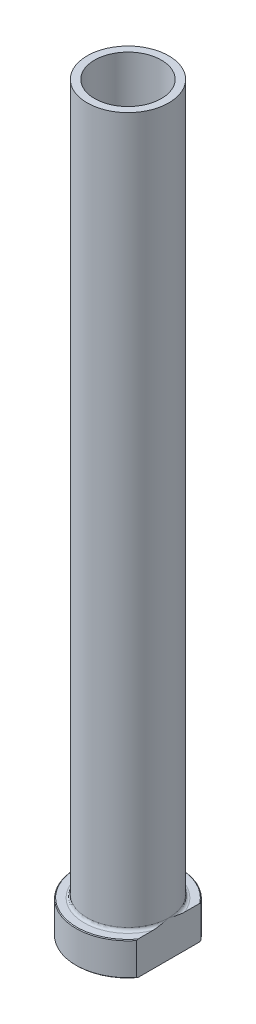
ISO-10303-21;
HEADER;
FILE_DESCRIPTION(('STEP AP214'),'2;1');
FILE_NAME('part.step','',(''),(''),'','','');
FILE_SCHEMA(('AUTOMOTIVE_DESIGN { 1 0 10303 214 1 1 1 1 }'));
ENDSEC;
DATA;
#1=APPLICATION_CONTEXT('core data for automotive mechanical design processes');
#2=APPLICATION_PROTOCOL_DEFINITION('international standard','automotive_design',2000,#1);
#3=PRODUCT_CONTEXT('',#1,'mechanical');
#4=PRODUCT('Part','Part','',(#3));
#5=PRODUCT_RELATED_PRODUCT_CATEGORY('part','',(#4));
#6=PRODUCT_DEFINITION_FORMATION('','',#4);
#7=PRODUCT_DEFINITION_CONTEXT('part definition',#1,'design');
#8=PRODUCT_DEFINITION('design','',#6,#7);
#9=PRODUCT_DEFINITION_SHAPE('','',#8);
#10=(LENGTH_UNIT() NAMED_UNIT(*) SI_UNIT(.MILLI.,.METRE.));
#11=(NAMED_UNIT(*) PLANE_ANGLE_UNIT() SI_UNIT($,.RADIAN.));
#12=(NAMED_UNIT(*) SI_UNIT($,.STERADIAN.) SOLID_ANGLE_UNIT());
#13=UNCERTAINTY_MEASURE_WITH_UNIT(LENGTH_MEASURE(1.E-05),#10,'distance_accuracy_value','');
#14=(GEOMETRIC_REPRESENTATION_CONTEXT(3) GLOBAL_UNCERTAINTY_ASSIGNED_CONTEXT((#13)) GLOBAL_UNIT_ASSIGNED_CONTEXT((#10,
#11,#12)) REPRESENTATION_CONTEXT('',''));
#15=CARTESIAN_POINT('',(0.,0.,0.));
#16=DIRECTION('',(0.,0.,1.));
#17=DIRECTION('',(1.,0.,0.));
#18=AXIS2_PLACEMENT_3D('',#15,#16,#17);
#19=CARTESIAN_POINT('',(0.,92.1876809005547,0.));
#20=DIRECTION('',(0.,1.,0.));
#21=DIRECTION('',(0.,0.,1.));
#22=AXIS2_PLACEMENT_3D('',#19,#20,#21);
#23=CYLINDRICAL_SURFACE('',#22,9.);
#24=CARTESIAN_POINT('',(0.,200.,0.));
#25=DIRECTION('',(0.,1.,0.));
#26=DIRECTION('',(0.,0.,1.));
#27=AXIS2_PLACEMENT_3D('',#24,#25,#26);
#28=CIRCLE('',#27,9.);
#29=CARTESIAN_POINT('',(0.,200.,9.));
#30=VERTEX_POINT('',#29);
#31=EDGE_CURVE('E167',#30,#30,#28,.T.);
#32=ORIENTED_EDGE('',*,*,#31,.T.);
#33=EDGE_LOOP('',(#32));
#34=FACE_BOUND('',#33,.T.);
#35=CARTESIAN_POINT('',(0.,145.,0.));
#36=DIRECTION('',(0.,1.,0.));
#37=DIRECTION('',(0.,0.,1.));
#38=AXIS2_PLACEMENT_3D('',#35,#36,#37);
#39=CIRCLE('',#38,9.);
#40=CARTESIAN_POINT('',(0.,145.,9.));
#41=VERTEX_POINT('',#40);
#42=EDGE_CURVE('E170',#41,#41,#39,.T.);
#43=ORIENTED_EDGE('',*,*,#42,.F.);
#44=EDGE_LOOP('',(#43));
#45=FACE_BOUND('',#44,.T.);
#46=ADVANCED_FACE('F32',(#34,#45),#23,.F.);
#47=CARTESIAN_POINT('',(-9.,200.,0.));
#48=DIRECTION('',(0.,1.,0.));
#49=DIRECTION('',(0.,0.,1.));
#50=AXIS2_PLACEMENT_3D('',#47,#48,#49);
#51=PLANE('',#50);
#52=CARTESIAN_POINT('',(0.,200.,0.));
#53=DIRECTION('',(0.,1.,0.));
#54=DIRECTION('',(0.,0.,1.));
#55=AXIS2_PLACEMENT_3D('',#52,#53,#54);
#56=CIRCLE('',#55,11.);
#57=CARTESIAN_POINT('',(0.,200.,11.));
#58=VERTEX_POINT('',#57);
#59=EDGE_CURVE('E174',#58,#58,#56,.T.);
#60=ORIENTED_EDGE('',*,*,#59,.T.);
#61=EDGE_LOOP('',(#60));
#62=FACE_BOUND('',#61,.T.);
#63=ORIENTED_EDGE('',*,*,#31,.F.);
#64=EDGE_LOOP('',(#63));
#65=FACE_BOUND('',#64,.T.);
#66=ADVANCED_FACE('F157',(#62,#65),#51,.T.);
#67=CARTESIAN_POINT('',(0.,92.1876809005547,0.));
#68=DIRECTION('',(0.,1.,0.));
#69=DIRECTION('',(0.,0.,1.));
#70=AXIS2_PLACEMENT_3D('',#67,#68,#69);
#71=CYLINDRICAL_SURFACE('',#70,11.);
#72=CARTESIAN_POINT('',(0.,9.8,0.));
#73=DIRECTION('',(0.,1.,0.));
#74=DIRECTION('',(0.,0.,1.));
#75=AXIS2_PLACEMENT_3D('',#72,#73,#74);
#76=CIRCLE('',#75,11.);
#77=CARTESIAN_POINT('',(11.,9.8,0.));
#78=VERTEX_POINT('',#77);
#79=EDGE_CURVE('E180',#78,#78,#76,.T.);
#80=ORIENTED_EDGE('',*,*,#79,.T.);
#81=EDGE_LOOP('',(#80));
#82=FACE_BOUND('',#81,.T.);
#83=ORIENTED_EDGE('',*,*,#59,.F.);
#84=EDGE_LOOP('',(#83));
#85=FACE_BOUND('',#84,.T.);
#86=ADVANCED_FACE('F162',(#82,#85),#71,.T.);
#87=CARTESIAN_POINT('',(-11.,9.,0.));
#88=DIRECTION('',(0.,1.,0.));
#89=DIRECTION('',(0.,0.,1.));
#90=AXIS2_PLACEMENT_3D('',#87,#88,#89);
#91=PLANE('',#90);
#92=DIRECTION('',(0.,0.,1.));
#93=VECTOR('',#92,1.);
#94=CARTESIAN_POINT('',(11.,9.,0.));
#95=LINE('',#94,#93);
#96=CARTESIAN_POINT('',(11.,9.,-8.33306666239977));
#97=VERTEX_POINT('',#96);
#98=CARTESIAN_POINT('',(11.,9.,-4.27083130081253));
#99=VERTEX_POINT('',#98);
#100=EDGE_CURVE('E54',#97,#99,#95,.T.);
#101=ORIENTED_EDGE('',*,*,#100,.F.);
#102=CARTESIAN_POINT('',(0.,9.,0.));
#103=DIRECTION('',(0.,1.,0.));
#104=DIRECTION('',(0.,0.,1.));
#105=AXIS2_PLACEMENT_3D('',#102,#103,#104);
#106=CIRCLE('',#105,13.7999999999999);
#107=CARTESIAN_POINT('',(11.,9.,8.33306666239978));
#108=VERTEX_POINT('',#107);
#109=EDGE_CURVE('E186',#97,#108,#106,.T.);
#110=ORIENTED_EDGE('',*,*,#109,.T.);
#111=CARTESIAN_POINT('',(11.,9.,4.27083130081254));
#112=VERTEX_POINT('',#111);
#113=EDGE_CURVE('E134',#112,#108,#95,.T.);
#114=ORIENTED_EDGE('',*,*,#113,.F.);
#115=CARTESIAN_POINT('',(0.,9.,0.));
#116=DIRECTION('',(0.,1.,0.));
#117=DIRECTION('',(0.,0.,1.));
#118=AXIS2_PLACEMENT_3D('',#115,#116,#117);
#119=CIRCLE('',#118,11.8);
#120=EDGE_CURVE('E183',#112,#99,#119,.F.);
#121=ORIENTED_EDGE('',*,*,#120,.T.);
#122=EDGE_LOOP('',(#101,#110,#114,#121));
#123=FACE_BOUND('',#122,.T.);
#124=ADVANCED_FACE('F197',(#123),#91,.T.);
#125=CARTESIAN_POINT('',(0.,92.1876809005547,0.));
#126=DIRECTION('',(0.,1.,0.));
#127=DIRECTION('',(0.,0.,1.));
#128=AXIS2_PLACEMENT_3D('',#125,#126,#127);
#129=CYLINDRICAL_SURFACE('',#128,14.);
#130=DIRECTION('',(0.,-1.,0.));
#131=VECTOR('',#130,1.);
#132=CARTESIAN_POINT('',(11.,200.,8.66025403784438));
#133=LINE('',#132,#131);
#134=CARTESIAN_POINT('',(11.,8.79999999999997,8.66025403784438));
#135=VERTEX_POINT('',#134);
#136=CARTESIAN_POINT('',(11.,0.200000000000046,8.66025403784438));
#137=VERTEX_POINT('',#136);
#138=EDGE_CURVE('E82',#135,#137,#133,.T.);
#139=ORIENTED_EDGE('',*,*,#138,.F.);
#140=CARTESIAN_POINT('',(0.,8.79999999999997,0.));
#141=DIRECTION('',(0.,1.,0.));
#142=DIRECTION('',(0.,0.,1.));
#143=AXIS2_PLACEMENT_3D('',#140,#141,#142);
#144=CIRCLE('',#143,14.);
#145=CARTESIAN_POINT('',(11.,8.79999999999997,-8.66025403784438));
#146=VERTEX_POINT('',#145);
#147=EDGE_CURVE('E95',#135,#146,#144,.F.);
#148=ORIENTED_EDGE('',*,*,#147,.T.);
#149=DIRECTION('',(0.,-1.,0.));
#150=VECTOR('',#149,1.);
#151=CARTESIAN_POINT('',(11.,200.,-8.66025403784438));
#152=LINE('',#151,#150);
#153=CARTESIAN_POINT('',(11.,0.200000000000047,-8.66025403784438));
#154=VERTEX_POINT('',#153);
#155=EDGE_CURVE('E192',#146,#154,#152,.T.);
#156=ORIENTED_EDGE('',*,*,#155,.T.);
#157=CARTESIAN_POINT('',(0.,0.200000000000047,0.));
#158=DIRECTION('',(0.,-1.,0.));
#159=DIRECTION('',(0.,0.,-1.));
#160=AXIS2_PLACEMENT_3D('',#157,#158,#159);
#161=CIRCLE('',#160,14.);
#162=EDGE_CURVE('E98',#154,#137,#161,.F.);
#163=ORIENTED_EDGE('',*,*,#162,.T.);
#164=EDGE_LOOP('',(#139,#148,#156,#163));
#165=FACE_BOUND('',#164,.T.);
#166=ADVANCED_FACE('F190',(#165),#129,.T.);
#167=CARTESIAN_POINT('',(-14.,0.,0.));
#168=DIRECTION('',(0.,-1.,0.));
#169=DIRECTION('',(0.,0.,-1.));
#170=AXIS2_PLACEMENT_3D('',#167,#168,#169);
#171=PLANE('',#170);
#172=CARTESIAN_POINT('',(0.,0.,0.));
#173=DIRECTION('',(0.,-1.,0.));
#174=DIRECTION('',(0.,0.,-1.));
#175=AXIS2_PLACEMENT_3D('',#172,#173,#174);
#176=CIRCLE('',#175,9.74999999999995);
#177=CARTESIAN_POINT('',(0.,0.,-9.74999999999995));
#178=VERTEX_POINT('',#177);
#179=EDGE_CURVE('E40',#178,#178,#176,.F.);
#180=ORIENTED_EDGE('',*,*,#179,.T.);
#181=EDGE_LOOP('',(#180));
#182=FACE_BOUND('',#181,.T.);
#183=DIRECTION('',(0.,0.,-1.));
#184=VECTOR('',#183,1.);
#185=CARTESIAN_POINT('',(11.,0.,8.66025403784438));
#186=LINE('',#185,#184);
#187=CARTESIAN_POINT('',(11.,0.,8.33306666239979));
#188=VERTEX_POINT('',#187);
#189=CARTESIAN_POINT('',(11.,0.,-8.33306666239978));
#190=VERTEX_POINT('',#189);
#191=EDGE_CURVE('E47',#188,#190,#186,.T.);
#192=ORIENTED_EDGE('',*,*,#191,.F.);
#193=CARTESIAN_POINT('',(0.,0.,0.));
#194=DIRECTION('',(0.,-1.,0.));
#195=DIRECTION('',(0.,0.,-1.));
#196=AXIS2_PLACEMENT_3D('',#193,#194,#195);
#197=CIRCLE('',#196,13.7999999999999);
#198=EDGE_CURVE('E92',#188,#190,#197,.T.);
#199=ORIENTED_EDGE('',*,*,#198,.T.);
#200=EDGE_LOOP('',(#192,#199));
#201=FACE_BOUND('',#200,.T.);
#202=ADVANCED_FACE('F91',(#182,#201),#171,.T.);
#203=CARTESIAN_POINT('',(0.,92.1876809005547,0.));
#204=DIRECTION('',(0.,1.,0.));
#205=DIRECTION('',(0.,0.,1.));
#206=AXIS2_PLACEMENT_3D('',#203,#204,#205);
#207=CYLINDRICAL_SURFACE('',#206,9.25);
#208=CARTESIAN_POINT('',(0.,0.499999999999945,0.));
#209=DIRECTION('',(0.,-1.,0.));
#210=DIRECTION('',(0.,0.,-1.));
#211=AXIS2_PLACEMENT_3D('',#208,#209,#210);
#212=CIRCLE('',#211,9.25);
#213=CARTESIAN_POINT('',(0.,0.499999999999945,-9.25));
#214=VERTEX_POINT('',#213);
#215=EDGE_CURVE('E11',#214,#214,#212,.T.);
#216=ORIENTED_EDGE('',*,*,#215,.T.);
#217=EDGE_LOOP('',(#216));
#218=FACE_BOUND('',#217,.T.);
#219=CARTESIAN_POINT('',(0.,133.,0.));
#220=DIRECTION('',(0.,1.,0.));
#221=DIRECTION('',(0.,0.,1.));
#222=AXIS2_PLACEMENT_3D('',#219,#220,#221);
#223=CIRCLE('',#222,9.25000000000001);
#224=CARTESIAN_POINT('',(0.,133.,9.25000000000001));
#225=VERTEX_POINT('',#224);
#226=EDGE_CURVE('E172',#225,#225,#223,.T.);
#227=ORIENTED_EDGE('',*,*,#226,.T.);
#228=EDGE_LOOP('',(#227));
#229=FACE_BOUND('',#228,.T.);
#230=ADVANCED_FACE('F215',(#218,#229),#207,.F.);
#231=CARTESIAN_POINT('',(0.,133.,0.));
#232=DIRECTION('',(0.,-1.,0.));
#233=DIRECTION('',(0.,0.,-1.));
#234=AXIS2_PLACEMENT_3D('',#231,#232,#233);
#235=CONICAL_SURFACE('',#234,9.25000000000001,0.0208303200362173);
#236=ORIENTED_EDGE('',*,*,#42,.T.);
#237=EDGE_LOOP('',(#236));
#238=FACE_BOUND('',#237,.T.);
#239=ORIENTED_EDGE('',*,*,#226,.F.);
#240=EDGE_LOOP('',(#239));
#241=FACE_BOUND('',#240,.T.);
#242=ADVANCED_FACE('F111',(#238,#241),#235,.F.);
#243=CARTESIAN_POINT('',(0.,9.8,0.));
#244=DIRECTION('',(0.,1.,0.));
#245=DIRECTION('',(0.,0.,1.));
#246=AXIS2_PLACEMENT_3D('',#243,#244,#245);
#247=TOROIDAL_SURFACE('',#246,11.8,0.8);
#248=ORIENTED_EDGE('',*,*,#120,.F.);
#249=CARTESIAN_POINT('',(11.,9.8,0.));
#250=CARTESIAN_POINT('',(11.,9.80000101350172,-1.16903105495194E-10));
#251=CARTESIAN_POINT('',(11.,9.80000202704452,3.62636611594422E-07));
#252=CARTESIAN_POINT('',(11.,9.80000392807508,1.38767038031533E-06));
#253=CARTESIAN_POINT('',(11.,9.80000479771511,2.07263771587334E-06));
#254=CARTESIAN_POINT('',(11.,9.80000659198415,3.71036672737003E-06));
#255=CARTESIAN_POINT('',(11.,9.80000749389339,4.68930209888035E-06));
#256=CARTESIAN_POINT('',(11.,9.80000912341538,6.73011572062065E-06));
#257=CARTESIAN_POINT('',(11.,9.8000098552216,7.78888147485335E-06));
#258=CARTESIAN_POINT('',(11.,9.80001253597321,1.18457654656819E-05));
#259=CARTESIAN_POINT('',(11.,9.80001433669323,1.49465068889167E-05));
#260=CARTESIAN_POINT('',(11.,9.80001733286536,2.1122675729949E-05));
#261=CARTESIAN_POINT('',(11.,9.80001856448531,2.41813359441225E-05));
#262=CARTESIAN_POINT('',(11.,9.80002366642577,3.70013752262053E-05));
#263=CARTESIAN_POINT('',(11.,9.8000274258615,4.68141710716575E-05));
#264=CARTESIAN_POINT('',(11.,9.80003302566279,6.54425668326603E-05));
#265=CARTESIAN_POINT('',(11.,9.800035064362,7.41984089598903E-05));
#266=CARTESIAN_POINT('',(11.,9.80004981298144,0.000138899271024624));
#267=CARTESIAN_POINT('',(11.,9.80006088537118,0.000195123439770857));
#268=CARTESIAN_POINT('',(11.,9.80010935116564,0.000417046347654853));
#269=CARTESIAN_POINT('',(11.,9.8001557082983,0.000580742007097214));
#270=CARTESIAN_POINT('',(11.,9.80033600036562,0.00122860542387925));
#271=CARTESIAN_POINT('',(11.,9.80046404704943,0.00171390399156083));
#272=CARTESIAN_POINT('',(11.,9.80097655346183,0.00364143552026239));
#273=CARTESIAN_POINT('',(11.,9.80136837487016,0.00508221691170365));
#274=CARTESIAN_POINT('',(11.,9.80300002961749,0.0110983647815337));
#275=CARTESIAN_POINT('',(11.,9.80423069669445,0.0156755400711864));
#276=CARTESIAN_POINT('',(10.9999999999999,9.82474721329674,0.0919599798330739));
#277=CARTESIAN_POINT('',(11.,9.84411511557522,0.163651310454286));
#278=CARTESIAN_POINT('',(11.,9.88193435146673,0.304144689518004));
#279=CARTESIAN_POINT('',(11.,9.90039088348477,0.372945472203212));
#280=CARTESIAN_POINT('',(11.,9.93953155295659,0.519420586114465));
#281=CARTESIAN_POINT('',(11.,9.96019740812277,0.597099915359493));
#282=CARTESIAN_POINT('',(11.,10.0014716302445,0.753402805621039));
#283=CARTESIAN_POINT('',(11.,10.0220767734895,0.832027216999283));
#284=CARTESIAN_POINT('',(11.,10.056901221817,0.966276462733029));
#285=CARTESIAN_POINT('',(11.,10.0712190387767,1.02187571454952));
#286=CARTESIAN_POINT('',(11.,10.0995828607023,1.13298938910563));
#287=CARTESIAN_POINT('',(11.,10.1136294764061,1.18850365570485));
#288=CARTESIAN_POINT('',(11.,10.1546367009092,1.35225812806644));
#289=CARTESIAN_POINT('',(11.,10.1812165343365,1.46059357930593));
#290=CARTESIAN_POINT('',(11.,10.2669117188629,1.81933910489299));
#291=CARTESIAN_POINT('',(11.,10.3231642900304,2.0704465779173));
#292=CARTESIAN_POINT('',(11.,10.425012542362,2.5777982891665));
#293=CARTESIAN_POINT('',(11.,10.4704839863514,2.83406864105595));
#294=CARTESIAN_POINT('',(11.,10.5272211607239,3.23096220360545));
#295=CARTESIAN_POINT('',(11.,10.5446090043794,3.37070252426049));
#296=CARTESIAN_POINT('',(11.,10.5730475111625,3.65081430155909));
#297=CARTESIAN_POINT('',(11.,10.5840998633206,3.79118557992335));
#298=CARTESIAN_POINT('',(11.,10.5982304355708,4.07161741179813));
#299=CARTESIAN_POINT('',(11.,10.6013499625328,4.21167576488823));
#300=CARTESIAN_POINT('',(11.,10.5975625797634,4.49161919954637));
#301=CARTESIAN_POINT('',(11.,10.5906655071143,4.63150431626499));
#302=CARTESIAN_POINT('',(11.,10.5704363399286,4.83931097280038));
#303=CARTESIAN_POINT('',(11.,10.562146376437,4.90772588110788));
#304=CARTESIAN_POINT('',(11.,10.5417448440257,5.04405523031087));
#305=CARTESIAN_POINT('',(11.,10.5296301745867,5.11196921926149));
#306=CARTESIAN_POINT('',(11.,10.5009997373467,5.24610291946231));
#307=CARTESIAN_POINT('',(11.,10.4845340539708,5.31233305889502));
#308=CARTESIAN_POINT('',(11.,10.4461783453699,5.44314716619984));
#309=CARTESIAN_POINT('',(11.,10.4242944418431,5.50773290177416));
#310=CARTESIAN_POINT('',(11.,10.373421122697,5.63494480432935));
#311=CARTESIAN_POINT('',(11.,10.3443615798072,5.69754429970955));
#312=CARTESIAN_POINT('',(11.,10.2940125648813,5.7875857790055));
#313=CARTESIAN_POINT('',(11.,10.2761248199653,5.8169284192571));
#314=CARTESIAN_POINT('',(11.,10.2377448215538,5.87384301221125));
#315=CARTESIAN_POINT('',(11.,10.2172553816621,5.9014168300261));
#316=CARTESIAN_POINT('',(11.,10.1754926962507,5.95144540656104));
#317=CARTESIAN_POINT('',(11.,10.1545053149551,5.9741361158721));
#318=CARTESIAN_POINT('',(11.,10.1098178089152,6.01675330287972));
#319=CARTESIAN_POINT('',(11.,10.0861159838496,6.03667803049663));
#320=CARTESIAN_POINT('',(11.,10.0355211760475,6.07288913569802));
#321=CARTESIAN_POINT('',(11.,10.0085887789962,6.08912169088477));
#322=CARTESIAN_POINT('',(11.,9.95208821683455,6.11604527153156));
#323=CARTESIAN_POINT('',(11.,9.92252876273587,6.12675386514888));
#324=CARTESIAN_POINT('',(11.,9.87044933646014,6.13915978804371));
#325=CARTESIAN_POINT('',(11.,9.84833164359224,6.14255775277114));
#326=CARTESIAN_POINT('',(11.,9.80383923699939,6.1455308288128));
#327=CARTESIAN_POINT('',(11.,9.78146463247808,6.14510750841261));
#328=CARTESIAN_POINT('',(11.,9.73715415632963,6.14047859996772));
#329=CARTESIAN_POINT('',(11.,9.71521765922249,6.13627886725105));
#330=CARTESIAN_POINT('',(11.,9.67228934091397,6.12446633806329));
#331=CARTESIAN_POINT('',(11.,9.65129820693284,6.11685110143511));
#332=CARTESIAN_POINT('',(11.,9.60293880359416,6.09531376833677));
#333=CARTESIAN_POINT('',(11.,9.57614979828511,6.08009633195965));
#334=CARTESIAN_POINT('',(11.,9.52533680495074,6.04559207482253));
#335=CARTESIAN_POINT('',(11.,9.50131971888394,6.02629542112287));
#336=CARTESIAN_POINT('',(11.,9.44252607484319,5.97248581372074));
#337=CARTESIAN_POINT('',(11.,9.40981527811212,5.93573547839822));
#338=CARTESIAN_POINT('',(11.,9.35019076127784,5.85789950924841));
#339=CARTESIAN_POINT('',(11.,9.3232859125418,5.81680738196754));
#340=CARTESIAN_POINT('',(11.,9.2753124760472,5.73382009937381));
#341=CARTESIAN_POINT('',(11.,9.25403723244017,5.69204233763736));
#342=CARTESIAN_POINT('',(11.,9.21507165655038,5.60682590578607));
#343=CARTESIAN_POINT('',(11.,9.19738479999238,5.56338567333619));
#344=CARTESIAN_POINT('',(11.,9.16492416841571,5.47505507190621));
#345=CARTESIAN_POINT('',(11.,9.1501744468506,5.43015597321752));
#346=CARTESIAN_POINT('',(11.,9.12332484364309,5.33960740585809));
#347=CARTESIAN_POINT('',(11.,9.11122363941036,5.29395832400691));
#348=CARTESIAN_POINT('',(11.,9.08512909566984,5.18461425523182));
#349=CARTESIAN_POINT('',(11.,9.07217244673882,5.1206724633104));
#350=CARTESIAN_POINT('',(11.,9.04991113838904,4.99214785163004));
#351=CARTESIAN_POINT('',(11.,9.04060805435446,4.92756476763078));
#352=CARTESIAN_POINT('',(11.,9.0173183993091,4.73294213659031));
#353=CARTESIAN_POINT('',(11.,9.00801869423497,4.60233754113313));
#354=CARTESIAN_POINT('',(11.,8.99902947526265,4.34550193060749));
#355=CARTESIAN_POINT('',(11.,8.99901276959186,4.21927902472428));
#356=CARTESIAN_POINT('',(11.,9.0059592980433,3.96771196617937));
#357=CARTESIAN_POINT('',(11.,9.01288556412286,3.84236670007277));
#358=CARTESIAN_POINT('',(11.,9.03307410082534,3.58284783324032));
#359=CARTESIAN_POINT('',(11.,9.0467683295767,3.44870920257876));
#360=CARTESIAN_POINT('',(11.,9.07939011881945,3.18114709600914));
#361=CARTESIAN_POINT('',(11.,9.09831526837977,3.04772331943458));
#362=CARTESIAN_POINT('',(11.,9.14092023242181,2.77842123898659));
#363=CARTESIAN_POINT('',(11.,9.16470161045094,2.64255921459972));
#364=CARTESIAN_POINT('',(11.,9.21593088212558,2.37116504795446));
#365=CARTESIAN_POINT('',(11.,9.24338827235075,2.23563471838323));
#366=CARTESIAN_POINT('',(11.,9.31183649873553,1.91532204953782));
#367=CARTESIAN_POINT('',(11.,9.35408384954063,1.73080986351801));
#368=CARTESIAN_POINT('',(11.,9.44184141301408,1.36477440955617));
#369=CARTESIAN_POINT('',(11.,9.48730948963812,1.18324089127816));
#370=CARTESIAN_POINT('',(11.,9.55452451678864,0.921934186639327));
#371=CARTESIAN_POINT('',(11.,9.5753457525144,0.841920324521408));
#372=CARTESIAN_POINT('',(11.,9.61742284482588,0.681633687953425));
#373=CARTESIAN_POINT('',(11.,9.63868020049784,0.601361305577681));
#374=CARTESIAN_POINT('',(11.,9.68246779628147,0.436916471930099));
#375=CARTESIAN_POINT('',(11.,9.70500908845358,0.352747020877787));
#376=CARTESIAN_POINT('',(11.,9.74991333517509,0.185809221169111));
#377=CARTESIAN_POINT('',(11.0000000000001,9.77227331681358,0.103040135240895));
#378=CARTESIAN_POINT('',(11.,9.79577053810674,0.0156708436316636));
#379=CARTESIAN_POINT('',(11.,9.79700248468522,0.0110889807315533));
#380=CARTESIAN_POINT('',(11.,9.79863444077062,0.00507176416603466));
#381=CARTESIAN_POINT('',(11.,9.79902527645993,0.00363459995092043));
#382=CARTESIAN_POINT('',(11.,9.79953658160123,0.00171158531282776));
#383=CARTESIAN_POINT('',(11.,9.79966439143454,0.00122718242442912));
#384=CARTESIAN_POINT('',(11.,9.79984439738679,0.000580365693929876));
#385=CARTESIAN_POINT('',(11.,9.79989071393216,0.000416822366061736));
#386=CARTESIAN_POINT('',(11.,9.79993914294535,0.000195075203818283));
#387=CARTESIAN_POINT('',(11.,9.79995021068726,0.000138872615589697));
#388=CARTESIAN_POINT('',(11.,9.79996494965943,7.41937214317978E-05));
#389=CARTESIAN_POINT('',(11.,9.7999669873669,6.54390977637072E-05));
#390=CARTESIAN_POINT('',(11.,9.79997258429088,4.68131828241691E-05));
#391=CARTESIAN_POINT('',(11.,9.7999763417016,3.70015847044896E-05));
#392=CARTESIAN_POINT('',(11.,9.7999814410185,2.41827815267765E-05));
#393=CARTESIAN_POINT('',(11.,9.7999826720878,2.11242125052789E-05));
#394=CARTESIAN_POINT('',(11.,9.79998566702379,1.49481337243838E-05));
#395=CARTESIAN_POINT('',(11.,9.799987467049,1.18473801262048E-05));
#396=CARTESIAN_POINT('',(11.,9.79999014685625,7.79037186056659E-06));
#397=CARTESIAN_POINT('',(11.,9.79999087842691,6.73154396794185E-06));
#398=CARTESIAN_POINT('',(11.,9.79999250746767,4.69056355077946E-06));
#399=CARTESIAN_POINT('',(11.,9.79999340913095,3.71152211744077E-06));
#400=CARTESIAN_POINT('',(11.,9.79999520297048,2.07354302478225E-06));
#401=CARTESIAN_POINT('',(11.,9.79999607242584,1.38844074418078E-06));
#402=CARTESIAN_POINT('',(11.,9.79999797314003,3.63067575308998E-07));
#403=CARTESIAN_POINT('',(11.,9.79999898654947,1.16901609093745E-10));
#404=CARTESIAN_POINT('',(11.,9.8,0.));
#405=B_SPLINE_CURVE_WITH_KNOTS('',3,(#249,#250,#251,#252,#253,#254,#255,#256,#257,#258,#259,
#260,#261,#262,#263,#264,#265,#266,#267,#268,#269,#270,#271,#272,#273,#274,#275,#276,#277,#278,
#279,#280,#281,#282,#283,#284,#285,#286,#287,#288,#289,#290,#291,#292,#293,#294,#295,#296,#297,
#298,#299,#300,#301,#302,#303,#304,#305,#306,#307,#308,#309,#310,#311,#312,#313,#314,#315,#316,
#317,#318,#319,#320,#321,#322,#323,#324,#325,#326,#327,#328,#329,#330,#331,#332,#333,#334,#335,
#336,#337,#338,#339,#340,#341,#342,#343,#344,#345,#346,#347,#348,#349,#350,#351,#352,#353,#354,
#355,#356,#357,#358,#359,#360,#361,#362,#363,#364,#365,#366,#367,#368,#369,#370,#371,#372,#373,
#374,#375,#376,#377,#378,#379,#380,#381,#382,#383,#384,#385,#386,#387,#388,#389,#390,#391,#392,
#393,#394,#395,#396,#397,#398,#399,#400,#401,#402,#403,#404),.UNSPECIFIED.,.T.,.F.,(4,2,2,2,2,2,
2,2,2,2,2,2,2,2,2,2,2,2,2,2,2,2,2,2,2,2,2,2,2,2,2,2,2,2,2,2,2,2,2,2,2,2,2,2,2,2,2,2,2,2,2,2,2,2,
2,2,2,2,2,2,2,2,2,2,2,2,2,2,2,2,2,2,2,2,2,2,2,4),(0.,3.06076108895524E-06,6.37973544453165E-06,
1.03502668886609E-05,1.42089725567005E-05,2.49252559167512E-05,3.48085548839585E-05,
6.62739386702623E-05,9.32104436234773E-05,0.000265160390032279,0.000775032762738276,
0.0022812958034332,0.00675996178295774,0.0209798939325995,0.24375656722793,0.457458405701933,
0.698601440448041,0.942439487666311,1.11467870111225,1.28646938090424,1.62111125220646,
2.39296447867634,3.17332138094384,3.59566656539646,4.01789910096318,4.43792849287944,
4.85754566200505,5.06420795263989,5.27103820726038,5.47558418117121,5.67990009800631,
5.88629782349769,5.9892848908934,6.09216151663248,6.18469603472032,6.27728883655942,
6.3711554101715,6.46472158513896,6.53154940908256,6.59834980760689,6.66504681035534,
6.73179153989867,6.82369899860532,6.91583057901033,7.06259901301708,7.20959014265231,
7.35003074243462,7.49060673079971,7.63229046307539,7.77390328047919,7.96948934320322,
8.1651596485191,8.55744262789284,8.93589815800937,9.31234923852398,9.71673016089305,
10.120925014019,10.5346477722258,10.9494607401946,11.5172595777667,12.0786596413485,
12.3266950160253,12.575811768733,12.8372206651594,13.0944202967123,13.1086548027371,
13.1131222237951,13.1146257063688,13.1151351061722,13.1153069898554,13.1153339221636,
13.1153653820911,13.115375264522,13.1153859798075,13.1153898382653,13.1153938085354,
13.115397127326,13.1154001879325),.UNSPECIFIED.);
#406=EDGE_CURVE('E126',#112,#78,#405,.T.);
#407=ORIENTED_EDGE('',*,*,#406,.T.);
#408=ORIENTED_EDGE('',*,*,#79,.F.);
#409=CARTESIAN_POINT('',(11.,9.8,0.));
#410=CARTESIAN_POINT('',(11.,9.79999898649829,1.1690706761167E-10));
#411=CARTESIAN_POINT('',(11.,9.79999797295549,-3.6263660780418E-07));
#412=CARTESIAN_POINT('',(11.,9.79999607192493,-1.38767037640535E-06));
#413=CARTESIAN_POINT('',(11.,9.79999520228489,-2.07263771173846E-06));
#414=CARTESIAN_POINT('',(11.,9.79999340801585,-3.71036672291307E-06));
#415=CARTESIAN_POINT('',(11.,9.79999250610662,-4.68930209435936E-06));
#416=CARTESIAN_POINT('',(11.,9.79999087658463,-6.73011571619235E-06));
#417=CARTESIAN_POINT('',(11.,9.7999901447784,-7.78888147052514E-06));
#418=CARTESIAN_POINT('',(11.,9.7999874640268,-1.18457654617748E-05));
#419=CARTESIAN_POINT('',(11.,9.79998566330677,-1.49465068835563E-05));
#420=CARTESIAN_POINT('',(11.,9.79998266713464,-2.11226757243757E-05));
#421=CARTESIAN_POINT('',(11.,9.79998143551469,-2.41813359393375E-05));
#422=CARTESIAN_POINT('',(11.,9.79997633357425,-3.7001375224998E-05));
#423=CARTESIAN_POINT('',(11.,9.79997257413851,-4.68141710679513E-05));
#424=CARTESIAN_POINT('',(11.,9.79996697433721,-6.54425668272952E-05));
#425=CARTESIAN_POINT('',(11.,9.79996493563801,-7.4198408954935E-05));
#426=CARTESIAN_POINT('',(11.,9.79995018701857,-0.00013889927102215));
#427=CARTESIAN_POINT('',(11.,9.79993911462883,-0.000195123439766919));
#428=CARTESIAN_POINT('',(11.,9.79989064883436,-0.000417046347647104));
#429=CARTESIAN_POINT('',(11.,9.7998442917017,-0.000580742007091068));
#430=CARTESIAN_POINT('',(11.,9.79966399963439,-0.00122860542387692));
#431=CARTESIAN_POINT('',(11.,9.79953595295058,-0.00171390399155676));
#432=CARTESIAN_POINT('',(11.,9.79902344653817,-0.00364143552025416));
#433=CARTESIAN_POINT('',(11.,9.79863162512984,-0.00508221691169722));
#434=CARTESIAN_POINT('',(11.,9.79699997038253,-0.0110983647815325));
#435=CARTESIAN_POINT('',(11.,9.79576930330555,-0.0156755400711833));
#436=CARTESIAN_POINT('',(10.9999999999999,9.7752527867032,-0.0919599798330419));
#437=CARTESIAN_POINT('',(11.,9.75588488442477,-0.163651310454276));
#438=CARTESIAN_POINT('',(11.,9.71806564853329,-0.30414468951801));
#439=CARTESIAN_POINT('',(11.,9.69960911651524,-0.372945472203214));
#440=CARTESIAN_POINT('',(11.,9.66046844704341,-0.519420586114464));
#441=CARTESIAN_POINT('',(11.,9.63980259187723,-0.597099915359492));
#442=CARTESIAN_POINT('',(11.,9.59852836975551,-0.753402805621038));
#443=CARTESIAN_POINT('',(11.,9.57792322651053,-0.832027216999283));
#444=CARTESIAN_POINT('',(11.,9.54309877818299,-0.966276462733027));
#445=CARTESIAN_POINT('',(11.,9.52878096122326,-1.02187571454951));
#446=CARTESIAN_POINT('',(11.,9.50041713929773,-1.13298938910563));
#447=CARTESIAN_POINT('',(11.,9.48637052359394,-1.18850365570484));
#448=CARTESIAN_POINT('',(11.,9.44536329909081,-1.35225812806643));
#449=CARTESIAN_POINT('',(11.,9.41878346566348,-1.46059357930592));
#450=CARTESIAN_POINT('',(11.,9.33308828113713,-1.81933910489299));
#451=CARTESIAN_POINT('',(11.,9.27683570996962,-2.0704465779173));
#452=CARTESIAN_POINT('',(11.,9.17498745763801,-2.5777982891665));
#453=CARTESIAN_POINT('',(11.,9.1295160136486,-2.83406864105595));
#454=CARTESIAN_POINT('',(11.,9.07277883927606,-3.23096220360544));
#455=CARTESIAN_POINT('',(11.,9.05539099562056,-3.37070252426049));
#456=CARTESIAN_POINT('',(11.,9.02695248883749,-3.65081430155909));
#457=CARTESIAN_POINT('',(11.,9.01590013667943,-3.79118557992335));
#458=CARTESIAN_POINT('',(11.,9.00176956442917,-4.07161741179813));
#459=CARTESIAN_POINT('',(11.,8.99865003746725,-4.21167576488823));
#460=CARTESIAN_POINT('',(11.,9.00243742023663,-4.49161919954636));
#461=CARTESIAN_POINT('',(11.,9.00933449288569,-4.63150431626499));
#462=CARTESIAN_POINT('',(11.,9.02956366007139,-4.83931097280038));
#463=CARTESIAN_POINT('',(11.,9.037853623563,-4.90772588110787));
#464=CARTESIAN_POINT('',(11.,9.05825515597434,-5.04405523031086));
#465=CARTESIAN_POINT('',(11.,9.07036982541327,-5.11196921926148));
#466=CARTESIAN_POINT('',(11.,9.09900026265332,-5.2461029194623));
#467=CARTESIAN_POINT('',(11.,9.11546594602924,-5.31233305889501));
#468=CARTESIAN_POINT('',(11.,9.15382165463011,-5.44314716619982));
#469=CARTESIAN_POINT('',(11.,9.17570555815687,-5.50773290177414));
#470=CARTESIAN_POINT('',(11.,9.22657887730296,-5.63494480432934));
#471=CARTESIAN_POINT('',(11.,9.25563842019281,-5.69754429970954));
#472=CARTESIAN_POINT('',(11.,9.30598743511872,-5.78758577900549));
#473=CARTESIAN_POINT('',(11.,9.32387518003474,-5.81692841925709));
#474=CARTESIAN_POINT('',(11.,9.36225517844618,-5.87384301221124));
#475=CARTESIAN_POINT('',(11.,9.38274461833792,-5.90141683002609));
#476=CARTESIAN_POINT('',(11.,9.42450730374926,-5.95144540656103));
#477=CARTESIAN_POINT('',(11.,9.44549468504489,-5.97413611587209));
#478=CARTESIAN_POINT('',(11.,9.49018219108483,-6.01675330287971));
#479=CARTESIAN_POINT('',(11.,9.51388401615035,-6.03667803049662));
#480=CARTESIAN_POINT('',(11.,9.56447882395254,-6.072889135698));
#481=CARTESIAN_POINT('',(11.,9.59141122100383,-6.08912169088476));
#482=CARTESIAN_POINT('',(11.,9.64791178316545,-6.11604527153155));
#483=CARTESIAN_POINT('',(11.,9.67747123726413,-6.12675386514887));
#484=CARTESIAN_POINT('',(11.,9.72955066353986,-6.1391597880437));
#485=CARTESIAN_POINT('',(11.,9.75166835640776,-6.14255775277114));
#486=CARTESIAN_POINT('',(11.,9.79616076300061,-6.14553082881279));
#487=CARTESIAN_POINT('',(11.,9.81853536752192,-6.1451075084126));
#488=CARTESIAN_POINT('',(11.,9.86284584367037,-6.14047859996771));
#489=CARTESIAN_POINT('',(11.,9.88478234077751,-6.13627886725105));
#490=CARTESIAN_POINT('',(11.,9.92771065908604,-6.12446633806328));
#491=CARTESIAN_POINT('',(11.,9.94870179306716,-6.1168511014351));
#492=CARTESIAN_POINT('',(11.,9.99706119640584,-6.09531376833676));
#493=CARTESIAN_POINT('',(11.,10.0238502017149,-6.08009633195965));
#494=CARTESIAN_POINT('',(11.,10.0746631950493,-6.04559207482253));
#495=CARTESIAN_POINT('',(11.,10.0986802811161,-6.02629542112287));
#496=CARTESIAN_POINT('',(11.,10.1574739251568,-5.97248581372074));
#497=CARTESIAN_POINT('',(11.,10.1901847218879,-5.93573547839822));
#498=CARTESIAN_POINT('',(11.,10.2498092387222,-5.85789950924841));
#499=CARTESIAN_POINT('',(11.,10.2767140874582,-5.81680738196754));
#500=CARTESIAN_POINT('',(11.,10.3246875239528,-5.73382009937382));
#501=CARTESIAN_POINT('',(11.,10.3459627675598,-5.69204233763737));
#502=CARTESIAN_POINT('',(11.,10.3849283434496,-5.60682590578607));
#503=CARTESIAN_POINT('',(11.,10.4026152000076,-5.5633856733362));
#504=CARTESIAN_POINT('',(11.,10.4350758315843,-5.47505507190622));
#505=CARTESIAN_POINT('',(11.,10.4498255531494,-5.43015597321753));
#506=CARTESIAN_POINT('',(11.,10.4766751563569,-5.3396074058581));
#507=CARTESIAN_POINT('',(11.,10.4887763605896,-5.29395832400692));
#508=CARTESIAN_POINT('',(11.,10.5148709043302,-5.18461425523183));
#509=CARTESIAN_POINT('',(11.,10.5278275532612,-5.12067246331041));
#510=CARTESIAN_POINT('',(11.,10.550088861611,-4.99214785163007));
#511=CARTESIAN_POINT('',(11.,10.5593919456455,-4.9275647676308));
#512=CARTESIAN_POINT('',(11.,10.5826816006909,-4.73294213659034));
#513=CARTESIAN_POINT('',(11.,10.591981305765,-4.60233754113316));
#514=CARTESIAN_POINT('',(11.,10.6009705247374,-4.34550193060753));
#515=CARTESIAN_POINT('',(11.,10.6009872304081,-4.21927902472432));
#516=CARTESIAN_POINT('',(11.,10.5940407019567,-3.96771196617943));
#517=CARTESIAN_POINT('',(11.,10.5871144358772,-3.84236670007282));
#518=CARTESIAN_POINT('',(11.,10.5669258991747,-3.58284783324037));
#519=CARTESIAN_POINT('',(11.,10.5532316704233,-3.44870920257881));
#520=CARTESIAN_POINT('',(11.,10.5206098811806,-3.18114709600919));
#521=CARTESIAN_POINT('',(11.,10.5016847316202,-3.04772331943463));
#522=CARTESIAN_POINT('',(11.,10.4590797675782,-2.77842123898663));
#523=CARTESIAN_POINT('',(11.,10.4352983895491,-2.64255921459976));
#524=CARTESIAN_POINT('',(11.,10.3840691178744,-2.3711650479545));
#525=CARTESIAN_POINT('',(11.,10.3566117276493,-2.23563471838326));
#526=CARTESIAN_POINT('',(11.,10.2881635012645,-1.91532204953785));
#527=CARTESIAN_POINT('',(11.,10.2459161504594,-1.73080986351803));
#528=CARTESIAN_POINT('',(11.,10.1581585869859,-1.36477440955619));
#529=CARTESIAN_POINT('',(11.,10.1126905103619,-1.18324089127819));
#530=CARTESIAN_POINT('',(11.,10.0454754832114,-0.921934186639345));
#531=CARTESIAN_POINT('',(11.,10.0246542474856,-0.841920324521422));
#532=CARTESIAN_POINT('',(11.,9.98257715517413,-0.681633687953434));
#533=CARTESIAN_POINT('',(11.,9.96131979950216,-0.60136130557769));
#534=CARTESIAN_POINT('',(11.,9.91753220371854,-0.436916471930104));
#535=CARTESIAN_POINT('',(11.,9.89499091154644,-0.352747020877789));
#536=CARTESIAN_POINT('',(11.,9.85008666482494,-0.185809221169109));
#537=CARTESIAN_POINT('',(10.9999999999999,9.82772668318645,-0.103040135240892));
#538=CARTESIAN_POINT('',(11.,9.80422946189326,-0.0156708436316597));
#539=CARTESIAN_POINT('',(11.,9.80299751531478,-0.0110889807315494));
#540=CARTESIAN_POINT('',(11.,9.80136555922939,-0.00507176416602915));
#541=CARTESIAN_POINT('',(11.,9.80097472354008,-0.00363459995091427));
#542=CARTESIAN_POINT('',(11.,9.80046341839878,-0.00171158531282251));
#543=CARTESIAN_POINT('',(11.,9.80033560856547,-0.00122718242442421));
#544=CARTESIAN_POINT('',(11.,9.80015560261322,-0.000580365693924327));
#545=CARTESIAN_POINT('',(11.,9.80010928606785,-0.000416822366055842));
#546=CARTESIAN_POINT('',(11.,9.80006085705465,-0.00019507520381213));
#547=CARTESIAN_POINT('',(11.,9.80004978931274,-0.000138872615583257));
#548=CARTESIAN_POINT('',(11.,9.80003505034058,-7.41937214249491E-05));
#549=CARTESIAN_POINT('',(11.,9.80003301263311,-6.5439097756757E-05));
#550=CARTESIAN_POINT('',(11.,9.80002741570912,-4.68131828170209E-05));
#551=CARTESIAN_POINT('',(11.,9.80002365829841,-3.7001584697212E-05));
#552=CARTESIAN_POINT('',(11.,9.80001855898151,-2.41827815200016E-05));
#553=CARTESIAN_POINT('',(11.,9.80001732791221,-2.11242124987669E-05));
#554=CARTESIAN_POINT('',(11.,9.80001433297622,-1.49481337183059E-05));
#555=CARTESIAN_POINT('',(11.,9.80001253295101,-1.18473801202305E-05));
#556=CARTESIAN_POINT('',(11.,9.80000985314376,-7.79037185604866E-06));
#557=CARTESIAN_POINT('',(11.,9.8000091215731,-6.73154396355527E-06));
#558=CARTESIAN_POINT('',(11.,9.80000749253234,-4.69056354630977E-06));
#559=CARTESIAN_POINT('',(11.,9.80000659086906,-3.71152211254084E-06));
#560=CARTESIAN_POINT('',(11.,9.80000479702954,-2.07354301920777E-06));
#561=CARTESIAN_POINT('',(11.,9.80000392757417,-1.38844073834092E-06));
#562=CARTESIAN_POINT('',(11.,9.80000202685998,-3.63067570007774E-07));
#563=CARTESIAN_POINT('',(11.,9.80000101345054,-1.16896757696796E-10));
#564=CARTESIAN_POINT('',(11.,9.8,0.));
#565=B_SPLINE_CURVE_WITH_KNOTS('',3,(#409,#410,#411,#412,#413,#414,#415,#416,#417,#418,#419,
#420,#421,#422,#423,#424,#425,#426,#427,#428,#429,#430,#431,#432,#433,#434,#435,#436,#437,#438,
#439,#440,#441,#442,#443,#444,#445,#446,#447,#448,#449,#450,#451,#452,#453,#454,#455,#456,#457,
#458,#459,#460,#461,#462,#463,#464,#465,#466,#467,#468,#469,#470,#471,#472,#473,#474,#475,#476,
#477,#478,#479,#480,#481,#482,#483,#484,#485,#486,#487,#488,#489,#490,#491,#492,#493,#494,#495,
#496,#497,#498,#499,#500,#501,#502,#503,#504,#505,#506,#507,#508,#509,#510,#511,#512,#513,#514,
#515,#516,#517,#518,#519,#520,#521,#522,#523,#524,#525,#526,#527,#528,#529,#530,#531,#532,#533,
#534,#535,#536,#537,#538,#539,#540,#541,#542,#543,#544,#545,#546,#547,#548,#549,#550,#551,#552,
#553,#554,#555,#556,#557,#558,#559,#560,#561,#562,#563,#564),.UNSPECIFIED.,.T.,.F.,(4,2,2,2,2,2,
2,2,2,2,2,2,2,2,2,2,2,2,2,2,2,2,2,2,2,2,2,2,2,2,2,2,2,2,2,2,2,2,2,2,2,2,2,2,2,2,2,2,2,2,2,2,2,2,
2,2,2,2,2,2,2,2,2,2,2,2,2,2,2,2,2,2,2,2,2,2,2,4),(0.,3.06076108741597E-06,6.37973544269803E-06,
1.03502668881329E-05,1.42089725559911E-05,2.49252559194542E-05,3.48085548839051E-05,
6.6273938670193E-05,9.32104436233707E-05,0.000265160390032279,0.000775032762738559,
0.0022812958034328,0.00675996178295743,0.0209798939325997,0.243756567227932,0.457458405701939,
0.698601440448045,0.942439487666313,1.11467870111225,1.28646938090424,1.62111125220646,
2.39296447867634,3.17332138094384,3.59566656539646,4.01789910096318,4.43792849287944,
4.85754566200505,5.06420795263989,5.27103820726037,5.4755841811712,5.6799000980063,
5.88629782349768,5.98928489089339,6.09216151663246,6.18469603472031,6.27728883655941,
6.37115541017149,6.46472158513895,6.53154940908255,6.59834980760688,6.66504681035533,
6.73179153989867,6.82369899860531,6.91583057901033,7.06259901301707,7.2095901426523,
7.35003074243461,7.49060673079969,7.63229046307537,7.77390328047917,7.9694893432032,
8.16515964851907,8.5574426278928,8.93589815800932,9.31234923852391,9.716730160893,
10.1209250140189,10.5346477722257,10.9494607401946,11.5172595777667,12.0786596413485,
12.3266950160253,12.575811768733,12.8372206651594,13.0944202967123,13.1086548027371,
13.1131222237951,13.1146257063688,13.1151351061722,13.1153069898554,13.1153339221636,
13.1153653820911,13.115375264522,13.1153859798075,13.1153898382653,13.1153938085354,
13.115397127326,13.1154001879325),.UNSPECIFIED.);
#566=EDGE_CURVE('E135',#78,#99,#565,.T.);
#567=ORIENTED_EDGE('',*,*,#566,.T.);
#568=EDGE_LOOP('',(#248,#407,#408,#567));
#569=FACE_BOUND('',#568,.T.);
#570=ADVANCED_FACE('F141',(#569),#247,.F.);
#571=CARTESIAN_POINT('',(0.,8.99999999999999,0.));
#572=DIRECTION('',(0.,-1.,0.));
#573=DIRECTION('',(0.,0.,-1.));
#574=AXIS2_PLACEMENT_3D('',#571,#572,#573);
#575=CONICAL_SURFACE('',#574,13.7999999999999,0.785398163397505);
#576=CARTESIAN_POINT('',(11.,0.799226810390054,-19.0534516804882));
#577=CARTESIAN_POINT('',(11.,1.04353773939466,-18.7713380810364));
#578=CARTESIAN_POINT('',(11.,1.287085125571,-18.4885613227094));
#579=CARTESIAN_POINT('',(11.,1.77243087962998,-17.9215029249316));
#580=CARTESIAN_POINT('',(11.,2.01422921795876,-17.6372212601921));
#581=CARTESIAN_POINT('',(11.,2.49596158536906,-17.0668479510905));
#582=CARTESIAN_POINT('',(11.,2.73589466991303,-16.7807555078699));
#583=CARTESIAN_POINT('',(11.,3.21348992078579,-16.206686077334));
#584=CARTESIAN_POINT('',(11.,3.45115209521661,-15.9187090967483));
#585=CARTESIAN_POINT('',(11.,4.1713625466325,-15.0380400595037));
#586=CARTESIAN_POINT('',(11.,4.64980550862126,-14.4419631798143));
#587=CARTESIAN_POINT('',(11.,5.35642548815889,-13.5393158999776));
#588=CARTESIAN_POINT('',(11.,5.59010018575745,-13.237044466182));
#589=CARTESIAN_POINT('',(11.,6.05311937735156,-12.6292064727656));
#590=CARTESIAN_POINT('',(11.,6.28246396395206,-12.3236399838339));
#591=CARTESIAN_POINT('',(11.,6.73635357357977,-11.7082856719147));
#592=CARTESIAN_POINT('',(11.,6.96089131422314,-11.3984924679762));
#593=CARTESIAN_POINT('',(11.,7.40382501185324,-10.7745304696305));
#594=CARTESIAN_POINT('',(11.,7.62222089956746,-10.4603616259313));
#595=CARTESIAN_POINT('',(11.,8.05178447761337,-9.82670701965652));
#596=CARTESIAN_POINT('',(11.,8.26294571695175,-9.50721687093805));
#597=CARTESIAN_POINT('',(11.,8.67621603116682,-8.8624224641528));
#598=CARTESIAN_POINT('',(11.,8.87832530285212,-8.53711833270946));
#599=CARTESIAN_POINT('',(11.,9.26987187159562,-7.88242741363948));
#600=CARTESIAN_POINT('',(11.,9.45939671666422,-7.55309323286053));
#601=CARTESIAN_POINT('',(11.,9.82494403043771,-6.88691791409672));
#602=CARTESIAN_POINT('',(11.,10.0009648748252,-6.55007587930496));
#603=CARTESIAN_POINT('',(11.,10.3359584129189,-5.86858126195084));
#604=CARTESIAN_POINT('',(11.,10.4949563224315,-5.52394117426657));
#605=CARTESIAN_POINT('',(11.,10.7921156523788,-4.82586409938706));
#606=CARTESIAN_POINT('',(11.,10.9302852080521,-4.47243060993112));
#607=CARTESIAN_POINT('',(11.,11.1840276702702,-3.74812634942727));
#608=CARTESIAN_POINT('',(11.,11.2989969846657,-3.37704109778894));
#609=CARTESIAN_POINT('',(11.,11.4966201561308,-2.62628112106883));
#610=CARTESIAN_POINT('',(11.,11.5792791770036,-2.24660777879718));
#611=CARTESIAN_POINT('',(11.,11.7067944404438,-1.48318013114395));
#612=CARTESIAN_POINT('',(11.,11.7518742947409,-1.09946392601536));
#613=CARTESIAN_POINT('',(11.,11.8017732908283,-0.329400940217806));
#614=CARTESIAN_POINT('',(11.,11.8065963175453,0.0569455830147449));
#615=CARTESIAN_POINT('',(11.,11.7755993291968,0.828327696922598));
#616=CARTESIAN_POINT('',(11.,11.7397415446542,1.21336173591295));
#617=CARTESIAN_POINT('',(11.,11.6300009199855,1.97793113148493));
#618=CARTESIAN_POINT('',(11.,11.5561107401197,2.35746541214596));
#619=CARTESIAN_POINT('',(11.,11.3744378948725,3.11099269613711));
#620=CARTESIAN_POINT('',(11.,11.2664224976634,3.48492860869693));
#621=CARTESIAN_POINT('',(11.,11.0222579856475,4.22335379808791));
#622=CARTESIAN_POINT('',(11.,10.8861087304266,4.58784302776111));
#623=CARTESIAN_POINT('',(11.,10.5561721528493,5.39220971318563));
#624=CARTESIAN_POINT('',(11.,10.3563639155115,5.82959722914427));
#625=CARTESIAN_POINT('',(11.,9.93013458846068,6.69131959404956));
#626=CARTESIAN_POINT('',(11.,9.70369800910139,7.11564666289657));
#627=CARTESIAN_POINT('',(11.,9.23013828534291,7.95366941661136));
#628=CARTESIAN_POINT('',(11.,8.9829729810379,8.36734108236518));
#629=CARTESIAN_POINT('',(11.,8.47313346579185,9.18483098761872));
#630=CARTESIAN_POINT('',(11.,8.21046237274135,9.5886511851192));
#631=CARTESIAN_POINT('',(11.,7.67160592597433,10.3902243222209));
#632=CARTESIAN_POINT('',(11.,7.39535669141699,10.7879341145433));
#633=CARTESIAN_POINT('',(11.,6.83321127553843,11.5764739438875));
#634=CARTESIAN_POINT('',(11.,6.5473147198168,11.9673037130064));
#635=CARTESIAN_POINT('',(11.,5.96814835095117,12.742746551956));
#636=CARTESIAN_POINT('',(11.,5.67488737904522,13.1273662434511));
#637=CARTESIAN_POINT('',(11.,5.08213887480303,13.8917532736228));
#638=CARTESIAN_POINT('',(11.,4.78265148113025,14.2715207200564));
#639=CARTESIAN_POINT('',(11.,4.18030013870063,15.0247813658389));
#640=CARTESIAN_POINT('',(11.,3.87746557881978,15.3982981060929));
#641=CARTESIAN_POINT('',(11.,3.2675364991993,16.1419438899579));
#642=CARTESIAN_POINT('',(11.,2.96044123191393,16.5120723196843));
#643=CARTESIAN_POINT('',(11.,2.34594437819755,17.2455248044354));
#644=CARTESIAN_POINT('',(11.,2.03857939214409,17.6088795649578));
#645=CARTESIAN_POINT('',(11.,1.42096006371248,18.3329959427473));
#646=CARTESIAN_POINT('',(11.,1.11070633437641,18.6937580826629));
#647=CARTESIAN_POINT('',(11.,0.799226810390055,19.0534516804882));
#648=B_SPLINE_CURVE_WITH_KNOTS('',3,(#576,#577,#578,#579,#580,#581,#582,#583,#584,#585,#586,
#587,#588,#589,#590,#591,#592,#593,#594,#595,#596,#597,#598,#599,#600,#601,#602,#603,#604,#605,
#606,#607,#608,#609,#610,#611,#612,#613,#614,#615,#616,#617,#618,#619,#620,#621,#622,#623,#624,
#625,#626,#627,#628,#629,#630,#631,#632,#633,#634,#635,#636,#637,#638,#639,#640,#641,#642,#643,
#644,#645,#646,#647),.UNSPECIFIED.,.F.,.F.,(4,2,2,2,2,2,2,2,2,2,2,2,2,2,2,2,2,2,2,2,2,2,2,2,2,2,
2,2,2,2,2,2,2,2,2,4),(0.,1.11959123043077,2.23920133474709,3.35934562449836,4.4794859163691,
6.77229631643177,7.91845486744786,9.06458887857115,10.2123513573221,11.3601267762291,
12.5089003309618,13.6576488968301,14.7973159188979,15.9371198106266,17.0752112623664,
18.2128570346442,19.3770913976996,20.5411396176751,21.6982107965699,22.8551703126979,
24.0132048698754,25.1714629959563,26.3377973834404,27.5041375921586,28.9455042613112,
30.387713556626,31.8329307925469,33.2778584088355,34.7303948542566,36.1829877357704,
37.6339130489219,39.0848060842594,40.5273412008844,41.9701326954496,43.397876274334,
44.8253234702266),.UNSPECIFIED.);
#649=EDGE_CURVE('E133',#146,#97,#648,.T.);
#650=ORIENTED_EDGE('',*,*,#649,.F.);
#651=ORIENTED_EDGE('',*,*,#147,.F.);
#652=EDGE_CURVE('E118',#108,#135,#648,.T.);
#653=ORIENTED_EDGE('',*,*,#652,.F.);
#654=ORIENTED_EDGE('',*,*,#109,.F.);
#655=EDGE_LOOP('',(#650,#651,#653,#654));
#656=FACE_BOUND('',#655,.T.);
#657=ADVANCED_FACE('F145',(#656),#575,.T.);
#658=CARTESIAN_POINT('',(0.,0.200000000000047,0.));
#659=DIRECTION('',(0.,1.,0.));
#660=DIRECTION('',(0.,0.,1.));
#661=AXIS2_PLACEMENT_3D('',#658,#659,#660);
#662=CONICAL_SURFACE('',#661,14.,0.785398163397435);
#663=CARTESIAN_POINT('',(11.,8.20077318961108,19.0534516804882));
#664=CARTESIAN_POINT('',(11.,7.95646226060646,18.7713380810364));
#665=CARTESIAN_POINT('',(11.,7.71291487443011,18.4885613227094));
#666=CARTESIAN_POINT('',(11.,7.2275691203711,17.9215029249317));
#667=CARTESIAN_POINT('',(11.,6.98577078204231,17.6372212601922));
#668=CARTESIAN_POINT('',(11.,6.50403841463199,17.0668479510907));
#669=CARTESIAN_POINT('',(11.,6.26410533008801,16.7807555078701));
#670=CARTESIAN_POINT('',(11.,5.78651007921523,16.2066860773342));
#671=CARTESIAN_POINT('',(11.,5.5488479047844,15.9187090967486));
#672=CARTESIAN_POINT('',(11.,4.82863745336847,15.0380400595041));
#673=CARTESIAN_POINT('',(11.,4.35019449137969,14.4419631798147));
#674=CARTESIAN_POINT('',(11.,3.64357451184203,13.5393158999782));
#675=CARTESIAN_POINT('',(11.,3.40989981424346,13.2370444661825));
#676=CARTESIAN_POINT('',(11.,2.94688062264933,12.6292064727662));
#677=CARTESIAN_POINT('',(11.,2.71753603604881,12.3236399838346));
#678=CARTESIAN_POINT('',(11.,2.26364642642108,11.7082856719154));
#679=CARTESIAN_POINT('',(11.,2.0391086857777,11.3984924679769));
#680=CARTESIAN_POINT('',(11.,1.59617498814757,10.7745304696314));
#681=CARTESIAN_POINT('',(11.,1.37777910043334,10.4603616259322));
#682=CARTESIAN_POINT('',(11.,0.948215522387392,9.82670701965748));
#683=CARTESIAN_POINT('',(11.,0.737054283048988,9.50721687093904));
#684=CARTESIAN_POINT('',(11.,0.323783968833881,8.86242246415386));
#685=CARTESIAN_POINT('',(11.,0.121674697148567,8.53711833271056));
#686=CARTESIAN_POINT('',(11.,-0.26987187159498,7.88242741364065));
#687=CARTESIAN_POINT('',(11.,-0.459396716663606,7.55309323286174));
#688=CARTESIAN_POINT('',(11.,-0.824944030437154,6.88691791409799));
#689=CARTESIAN_POINT('',(11.,-1.00096487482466,6.55007587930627));
#690=CARTESIAN_POINT('',(11.,-1.33595841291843,5.86858126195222));
#691=CARTESIAN_POINT('',(11.,-1.49495632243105,5.52394117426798));
#692=CARTESIAN_POINT('',(11.,-1.79211565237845,4.82586409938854));
#693=CARTESIAN_POINT('',(11.,-1.93028520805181,4.47243060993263));
#694=CARTESIAN_POINT('',(11.,-2.18402767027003,3.74812634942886));
#695=CARTESIAN_POINT('',(11.,-2.29899698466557,3.37704109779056));
#696=CARTESIAN_POINT('',(11.,-2.49662015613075,2.62628112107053));
#697=CARTESIAN_POINT('',(11.,-2.57927917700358,2.24660777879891));
#698=CARTESIAN_POINT('',(11.,-2.7067944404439,1.48318013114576));
#699=CARTESIAN_POINT('',(11.,-2.75187429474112,1.0994639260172));
#700=CARTESIAN_POINT('',(11.,-2.80177329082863,0.329400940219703));
#701=CARTESIAN_POINT('',(11.,-2.80659631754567,-0.0569455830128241));
#702=CARTESIAN_POINT('',(11.,-2.77559932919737,-0.828327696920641));
#703=CARTESIAN_POINT('',(11.,-2.73974154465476,-1.21336173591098));
#704=CARTESIAN_POINT('',(11.,-2.63000091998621,-1.97793113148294));
#705=CARTESIAN_POINT('',(11.,-2.5561107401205,-2.35746541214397));
#706=CARTESIAN_POINT('',(11.,-2.37443789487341,-3.11099269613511));
#707=CARTESIAN_POINT('',(11.,-2.26642249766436,-3.48492860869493));
#708=CARTESIAN_POINT('',(11.,-2.02225798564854,-4.22335379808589));
#709=CARTESIAN_POINT('',(11.,-1.88610873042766,-4.58784302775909));
#710=CARTESIAN_POINT('',(11.,-1.55617215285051,-5.39220971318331));
#711=CARTESIAN_POINT('',(11.,-1.35636391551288,-5.82959722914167));
#712=CARTESIAN_POINT('',(11.,-0.930134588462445,-6.6913195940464));
#713=CARTESIAN_POINT('',(11.,-0.703698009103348,-7.11564666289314));
#714=CARTESIAN_POINT('',(11.,-0.230138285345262,-7.95366941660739));
#715=CARTESIAN_POINT('',(11.,0.0170270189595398,-8.36734108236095));
#716=CARTESIAN_POINT('',(11.,0.526866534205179,-9.18483098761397));
#717=CARTESIAN_POINT('',(11.,0.789537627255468,-9.58865118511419));
#718=CARTESIAN_POINT('',(11.,1.32839407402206,-10.3902243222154));
#719=CARTESIAN_POINT('',(11.,1.60464330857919,-10.7879341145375));
#720=CARTESIAN_POINT('',(11.,2.16678872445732,-11.5764739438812));
#721=CARTESIAN_POINT('',(11.,2.45268528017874,-11.9673037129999));
#722=CARTESIAN_POINT('',(11.,3.03185164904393,-12.742746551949));
#723=CARTESIAN_POINT('',(11.,3.32511262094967,-13.1273662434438));
#724=CARTESIAN_POINT('',(11.,3.91786112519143,-13.891753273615));
#725=CARTESIAN_POINT('',(11.,4.21734851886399,-14.2715207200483));
#726=CARTESIAN_POINT('',(11.,4.81969986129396,-15.0247813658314));
#727=CARTESIAN_POINT('',(11.,5.12253442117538,-15.3982981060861));
#728=CARTESIAN_POINT('',(11.,5.73246350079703,-16.1419438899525));
#729=CARTESIAN_POINT('',(11.,6.039558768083,-16.5120723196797));
#730=CARTESIAN_POINT('',(11.,6.65405562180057,-17.2455248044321));
#731=CARTESIAN_POINT('',(11.,6.96142060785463,-17.6088795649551));
#732=CARTESIAN_POINT('',(11.,7.57903993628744,-18.332995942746));
#733=CARTESIAN_POINT('',(11.,7.88929366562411,-18.6937580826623));
#734=CARTESIAN_POINT('',(11.,8.20077318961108,-19.0534516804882));
#735=B_SPLINE_CURVE_WITH_KNOTS('',3,(#663,#664,#665,#666,#667,#668,#669,#670,#671,#672,#673,
#674,#675,#676,#677,#678,#679,#680,#681,#682,#683,#684,#685,#686,#687,#688,#689,#690,#691,#692,
#693,#694,#695,#696,#697,#698,#699,#700,#701,#702,#703,#704,#705,#706,#707,#708,#709,#710,#711,
#712,#713,#714,#715,#716,#717,#718,#719,#720,#721,#722,#723,#724,#725,#726,#727,#728,#729,#730,
#731,#732,#733,#734),.UNSPECIFIED.,.F.,.F.,(4,2,2,2,2,2,2,2,2,2,2,2,2,2,2,2,2,2,2,2,2,2,2,2,2,2,
2,2,2,2,2,2,2,2,2,4),(0.,1.11959123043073,2.23920133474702,3.35934562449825,4.47948591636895,
6.7722963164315,7.91845486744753,9.06458887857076,10.2123513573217,11.3601267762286,
12.5089003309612,13.6576488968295,14.7973159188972,15.9371198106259,17.0752112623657,
18.2128570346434,19.3770913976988,20.5411396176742,21.6982107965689,22.8551703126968,
24.0132048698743,25.1714629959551,26.3377973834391,27.5041375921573,28.9455042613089,
30.3877135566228,31.8329307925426,33.2778584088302,34.7303948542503,36.1829877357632,
37.6339130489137,39.0848060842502,40.5273412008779,41.9701326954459,43.397876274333,
44.8253234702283),.UNSPECIFIED.);
#736=EDGE_CURVE('E79',#137,#188,#735,.T.);
#737=ORIENTED_EDGE('',*,*,#736,.F.);
#738=ORIENTED_EDGE('',*,*,#162,.F.);
#739=EDGE_CURVE('E87',#190,#154,#735,.T.);
#740=ORIENTED_EDGE('',*,*,#739,.F.);
#741=ORIENTED_EDGE('',*,*,#198,.F.);
#742=EDGE_LOOP('',(#737,#738,#740,#741));
#743=FACE_BOUND('',#742,.T.);
#744=ADVANCED_FACE('F94',(#743),#662,.T.);
#745=CARTESIAN_POINT('',(11.,200.,8.66025403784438));
#746=DIRECTION('',(-1.,0.,0.));
#747=DIRECTION('',(0.,0.,1.));
#748=AXIS2_PLACEMENT_3D('',#745,#746,#747);
#749=PLANE('',#748);
#750=ORIENTED_EDGE('',*,*,#406,.F.);
#751=ORIENTED_EDGE('',*,*,#113,.T.);
#752=ORIENTED_EDGE('',*,*,#652,.T.);
#753=ORIENTED_EDGE('',*,*,#138,.T.);
#754=ORIENTED_EDGE('',*,*,#736,.T.);
#755=ORIENTED_EDGE('',*,*,#191,.T.);
#756=ORIENTED_EDGE('',*,*,#739,.T.);
#757=ORIENTED_EDGE('',*,*,#155,.F.);
#758=ORIENTED_EDGE('',*,*,#649,.T.);
#759=ORIENTED_EDGE('',*,*,#100,.T.);
#760=ORIENTED_EDGE('',*,*,#566,.F.);
#761=EDGE_LOOP('',(#750,#751,#752,#753,#754,#755,#756,#757,#758,#759,#760));
#762=FACE_BOUND('',#761,.T.);
#763=ADVANCED_FACE('F80',(#762),#749,.F.);
#764=CARTESIAN_POINT('',(0.,0.,0.));
#765=DIRECTION('',(0.,-1.,0.));
#766=DIRECTION('',(0.,0.,-1.));
#767=AXIS2_PLACEMENT_3D('',#764,#765,#766);
#768=CONICAL_SURFACE('',#767,9.74999999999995,0.785398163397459);
#769=ORIENTED_EDGE('',*,*,#215,.F.);
#770=EDGE_LOOP('',(#769));
#771=FACE_BOUND('',#770,.T.);
#772=ORIENTED_EDGE('',*,*,#179,.F.);
#773=EDGE_LOOP('',(#772));
#774=FACE_BOUND('',#773,.T.);
#775=ADVANCED_FACE('F34',(#771,#774),#768,.F.);
#776=CLOSED_SHELL('',(#46,#66,#86,#124,#166,#202,#230,#242,#570,#657,#744,#763,#775));
#777=MANIFOLD_SOLID_BREP('B2',#776);
#778=ADVANCED_BREP_SHAPE_REPRESENTATION('',(#18,#777),#14);
#779=SHAPE_DEFINITION_REPRESENTATION(#9,#778);
ENDSEC;
END-ISO-10303-21;
